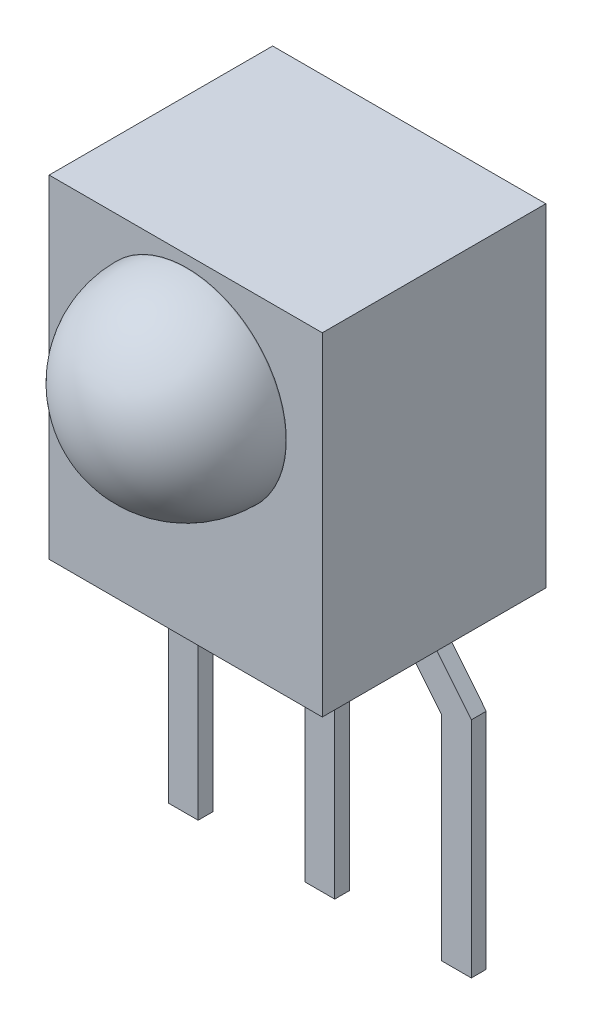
from build123d import *

# Parameters (mm, degrees)
ESQUISSE1_W       = 5.5
ESQUISSE1_H       = 6.7
EXTRUSION1_DEPTH  = 4.5
ESQUISSE2_W       = 0.6
ESQUISSE2_H       = 5.749912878
EXTRUSION2_DEPTH  = 0.3
ESQUISSE3_R       = 2
EXTRUSION3_DEPTH  = 0.01
D_ME1_FACE_RADIUS = 2
D_ME1_HEIGHT      = 2


with BuildPart() as part:
    # Esquisse1 → Extrusion1 (new body)
    with BuildSketch(Plane.XY):
        with Locations((-3.56661409, 3.35)):
            Rectangle(ESQUISSE1_W, ESQUISSE1_H)
    extrude(amount=EXTRUSION1_DEPTH)

    # Esquisse2 → Extrusion2 (add)
    with BuildSketch(Plane(origin=(0, 0, 1.5), x_dir=(-1, 0, 0), z_dir=(0, 0, -1))):
        Polygon((5.611460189, 0), (4.841233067, 0), (6.01661409, -1.460223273), (6.01661409, -5.749912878), (6.61661409, -5.749912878), (6.61661409, -1.24874325), align=None)
        with Locations((3.56661409, -2.874956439)):
            Rectangle(ESQUISSE2_W, ESQUISSE2_H)
        Polygon((0.51661409, -1.24874325), (0.51661409, -5.749912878), (1.11661409, -5.749912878), (1.11661409, -1.460223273), (2.291995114, 0), (1.521767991, 0), align=None)
    extrude(amount=-EXTRUSION2_DEPTH)

    # Esquisse3 → Extrusion3 (add)
    with BuildSketch(Plane.XY.offset(4.5)):
        with Locations(Location((-3.541467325, 4.468864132, 0), (0, 0, 180))):
            Circle(ESQUISSE3_R)
    extrude(amount=EXTRUSION3_DEPTH)

    # D_me1: a dome of height H over a round flat face of radius A is a cap of a sphere of radius (A * A + H * H) / (2 * H)
    d_me1_r = (D_ME1_FACE_RADIUS * D_ME1_FACE_RADIUS + D_ME1_HEIGHT * D_ME1_HEIGHT) / (2 * D_ME1_HEIGHT)
    d_me1_base = Plane((-3.541467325, 4.468864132, 4.51), z_dir=(0, 0, 1))
    with Locations(d_me1_base.offset(D_ME1_HEIGHT - d_me1_r)):
        d_me1_ball = Sphere(d_me1_r, mode=Mode.PRIVATE)
    add(split(d_me1_ball, bisect_by=d_me1_base, keep=Keep.TOP, mode=Mode.PRIVATE))


solid = part.part
